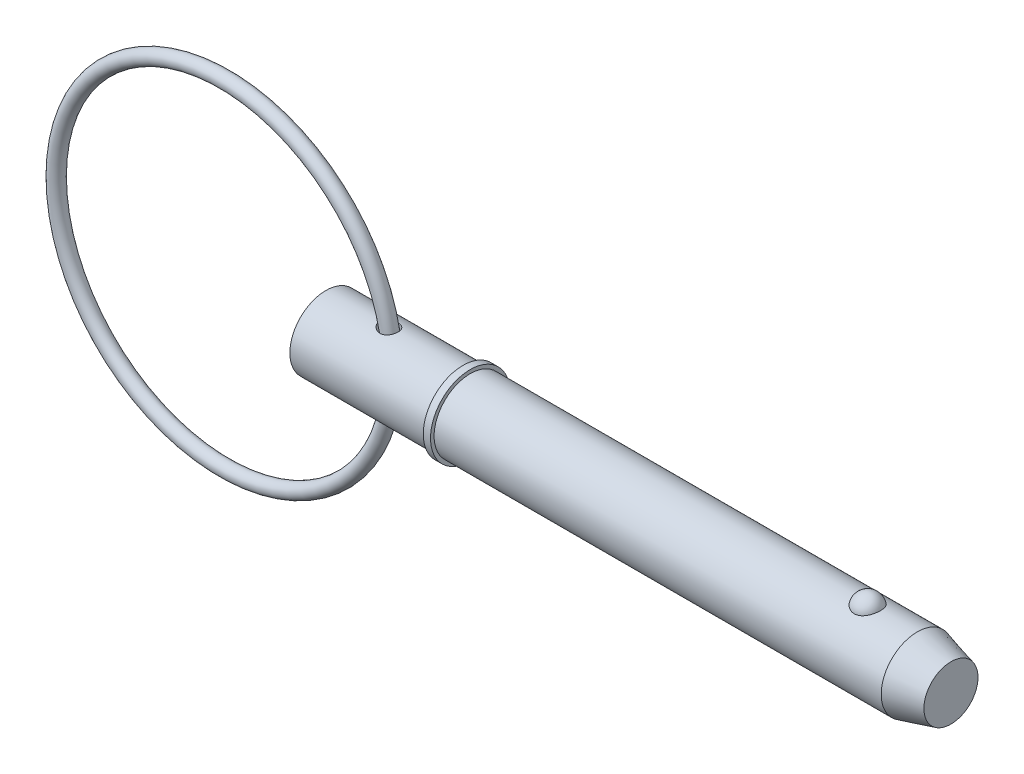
ISO-10303-21;
HEADER;
FILE_DESCRIPTION(('STEP AP214'),'2;1');
FILE_NAME('part.step','',(''),(''),'','','');
FILE_SCHEMA(('AUTOMOTIVE_DESIGN { 1 0 10303 214 1 1 1 1 }'));
ENDSEC;
DATA;
#1=APPLICATION_CONTEXT('core data for automotive mechanical design processes');
#2=APPLICATION_PROTOCOL_DEFINITION('international standard','automotive_design',2000,#1);
#3=PRODUCT_CONTEXT('',#1,'mechanical');
#4=PRODUCT('Part','Part','',(#3));
#5=PRODUCT_RELATED_PRODUCT_CATEGORY('part','',(#4));
#6=PRODUCT_DEFINITION_FORMATION('','',#4);
#7=PRODUCT_DEFINITION_CONTEXT('part definition',#1,'design');
#8=PRODUCT_DEFINITION('design','',#6,#7);
#9=PRODUCT_DEFINITION_SHAPE('','',#8);
#10=(LENGTH_UNIT() NAMED_UNIT(*) SI_UNIT(.MILLI.,.METRE.));
#11=(NAMED_UNIT(*) PLANE_ANGLE_UNIT() SI_UNIT($,.RADIAN.));
#12=(NAMED_UNIT(*) SI_UNIT($,.STERADIAN.) SOLID_ANGLE_UNIT());
#13=UNCERTAINTY_MEASURE_WITH_UNIT(LENGTH_MEASURE(1.E-05),#10,'distance_accuracy_value','');
#14=(GEOMETRIC_REPRESENTATION_CONTEXT(3) GLOBAL_UNCERTAINTY_ASSIGNED_CONTEXT((#13)) GLOBAL_UNIT_ASSIGNED_CONTEXT((#10,
#11,#12)) REPRESENTATION_CONTEXT('',''));
#15=CARTESIAN_POINT('',(0.,0.,0.));
#16=DIRECTION('',(0.,0.,1.));
#17=DIRECTION('',(1.,0.,0.));
#18=AXIS2_PLACEMENT_3D('',#15,#16,#17);
#19=CARTESIAN_POINT('',(-13.4013067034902,0.,0.));
#20=DIRECTION('',(0.,0.,1.));
#21=DIRECTION('',(1.,0.,0.));
#22=AXIS2_PLACEMENT_3D('',#19,#20,#21);
#23=TOROIDAL_SURFACE('',#22,22.225,0.952999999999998);
#24=CARTESIAN_POINT('',(9.77669329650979,0.,0.));
#25=VERTEX_POINT('',#24);
#26=VERTEX_LOOP('',#25);
#27=FACE_BOUND('',#26,.T.);
#28=ADVANCED_FACE('P0_F12',(#27),#23,.T.);
#29=CLOSED_SHELL('',(#28));
#30=MANIFOLD_SOLID_BREP('P0_B1',#29);
#31=CARTESIAN_POINT('',(0.,0.,0.));
#32=DIRECTION('',(1.,0.,0.));
#33=DIRECTION('',(0.,0.,-1.));
#34=AXIS2_PLACEMENT_3D('',#31,#32,#33);
#35=CYLINDRICAL_SURFACE('',#34,4.765);
#36=CARTESIAN_POINT('',(7.48459594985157,4.685973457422,-0.864220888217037));
#37=CARTESIAN_POINT('',(7.53849733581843,4.67711144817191,-0.912273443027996));
#38=CARTESIAN_POINT('',(7.59654891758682,4.66833039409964,-0.955745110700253));
#39=CARTESIAN_POINT('',(7.71924602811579,4.65195567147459,-1.03251233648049));
#40=CARTESIAN_POINT('',(7.78389917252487,4.64436340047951,-1.06579596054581));
#41=CARTESIAN_POINT('',(7.91808098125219,4.63129108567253,-1.12124172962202));
#42=CARTESIAN_POINT('',(7.98761280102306,4.62581242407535,-1.14339659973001));
#43=CARTESIAN_POINT('',(8.12956198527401,4.61771699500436,-1.17566870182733));
#44=CARTESIAN_POINT('',(8.20197774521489,4.61509865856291,-1.18579253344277));
#45=CARTESIAN_POINT('',(8.34550810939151,4.6131791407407,-1.19323853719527));
#46=CARTESIAN_POINT('',(8.41660306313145,4.61378793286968,-1.19090812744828));
#47=CARTESIAN_POINT('',(8.55721866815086,4.61812874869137,-1.17396277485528));
#48=CARTESIAN_POINT('',(8.62673979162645,4.62185982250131,-1.15935156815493));
#49=CARTESIAN_POINT('',(8.75801373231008,4.63172632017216,-1.11925454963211));
#50=CARTESIAN_POINT('',(8.81998342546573,4.63771186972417,-1.09443918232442));
#51=CARTESIAN_POINT('',(8.93863698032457,4.65140179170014,-1.03470792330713));
#52=CARTESIAN_POINT('',(8.99532131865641,4.65910600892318,-0.999792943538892));
#53=CARTESIAN_POINT('',(9.10080884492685,4.67519705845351,-0.921583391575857));
#54=CARTESIAN_POINT('',(9.14973848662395,4.68356861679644,-0.878455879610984));
#55=CARTESIAN_POINT('',(9.23971126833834,4.70019813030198,-0.784620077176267));
#56=CARTESIAN_POINT('',(9.28075401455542,4.7084560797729,-0.733911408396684));
#57=CARTESIAN_POINT('',(9.35441071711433,4.7240688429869,-0.62563775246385));
#58=CARTESIAN_POINT('',(9.38691359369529,4.73141115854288,-0.567995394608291));
#59=CARTESIAN_POINT('',(9.44203216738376,4.74427907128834,-0.447974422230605));
#60=CARTESIAN_POINT('',(9.46464743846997,4.74980459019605,-0.385595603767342));
#61=CARTESIAN_POINT('',(9.49961110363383,4.75848927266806,-0.257248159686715));
#62=CARTESIAN_POINT('',(9.51186382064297,4.76162635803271,-0.191251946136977));
#63=CARTESIAN_POINT('',(9.52545294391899,4.76511165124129,-0.0580729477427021));
#64=CARTESIAN_POINT('',(9.52678936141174,4.76545986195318,0.00910983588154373));
#65=CARTESIAN_POINT('',(9.51851557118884,4.76333054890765,0.142723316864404));
#66=CARTESIAN_POINT('',(9.50891008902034,4.76085424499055,0.209154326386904));
#67=CARTESIAN_POINT('',(9.47899306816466,4.75334441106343,0.339411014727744));
#68=CARTESIAN_POINT('',(9.45868126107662,4.74831081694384,0.403236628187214));
#69=CARTESIAN_POINT('',(9.4078294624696,4.73622777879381,0.526509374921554));
#70=CARTESIAN_POINT('',(9.37728413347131,4.72917728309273,0.585954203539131));
#71=CARTESIAN_POINT('',(9.30671117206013,4.71383320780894,0.698745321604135));
#72=CARTESIAN_POINT('',(9.26668347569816,4.70553961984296,0.752091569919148));
#73=CARTESIAN_POINT('',(9.17821531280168,4.68864637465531,0.851083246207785));
#74=CARTESIAN_POINT('',(9.12978756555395,4.68004719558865,0.896740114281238));
#75=CARTESIAN_POINT('',(9.02575872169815,4.66350833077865,0.97912505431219));
#76=CARTESIAN_POINT('',(8.97015856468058,4.65556855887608,1.01585429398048));
#77=CARTESIAN_POINT('',(8.85409306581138,4.6413534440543,1.0789347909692));
#78=CARTESIAN_POINT('',(8.79369898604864,4.63505812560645,1.10541268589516));
#79=CARTESIAN_POINT('',(8.66918290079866,4.62469916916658,1.1479836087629));
#80=CARTESIAN_POINT('',(8.60506121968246,4.62063533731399,1.1640775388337));
#81=CARTESIAN_POINT('',(8.47537782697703,4.61517348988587,1.18554696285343));
#82=CARTESIAN_POINT('',(8.4098281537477,4.61375835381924,1.19099130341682));
#83=CARTESIAN_POINT('',(8.2786938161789,4.61362908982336,1.19149080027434));
#84=CARTESIAN_POINT('',(8.21310914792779,4.61491539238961,1.18654430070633));
#85=CARTESIAN_POINT('',(8.08152457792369,4.62006017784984,1.16635311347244));
#86=CARTESIAN_POINT('',(8.01557748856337,4.62399895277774,1.15078675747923));
#87=CARTESIAN_POINT('',(7.88704537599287,4.63403793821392,1.10966738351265));
#88=CARTESIAN_POINT('',(7.82446148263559,4.64013886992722,1.08411103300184));
#89=CARTESIAN_POINT('',(7.70057947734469,4.65423592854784,1.02195168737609));
#90=CARTESIAN_POINT('',(7.63957197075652,4.66232221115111,0.984788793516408));
#91=CARTESIAN_POINT('',(7.52457021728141,4.67924552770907,0.900950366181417));
#92=CARTESIAN_POINT('',(7.47057819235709,4.68808279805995,0.854271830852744));
#93=CARTESIAN_POINT('',(7.37028930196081,4.70567913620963,0.751386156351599));
#94=CARTESIAN_POINT('',(7.32416327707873,4.7144333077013,0.695010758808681));
#95=CARTESIAN_POINT('',(7.24276674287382,4.73060166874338,0.574719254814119));
#96=CARTESIAN_POINT('',(7.20749051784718,4.73801656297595,0.510807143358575));
#97=CARTESIAN_POINT('',(7.15148495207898,4.75009927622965,0.381705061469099));
#98=CARTESIAN_POINT('',(7.12994463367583,4.7549169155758,0.31688231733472));
#99=CARTESIAN_POINT('',(7.09904467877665,4.76189692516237,0.184270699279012));
#100=CARTESIAN_POINT('',(7.08967554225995,4.76406136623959,0.116484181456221));
#101=CARTESIAN_POINT('',(7.08394150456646,4.76538257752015,-0.0133529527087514));
#102=CARTESIAN_POINT('',(7.0864533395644,4.76479916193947,-0.0753538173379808));
#103=CARTESIAN_POINT('',(7.10181380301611,4.76127985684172,-0.197993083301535));
#104=CARTESIAN_POINT('',(7.11466291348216,4.75834385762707,-0.258631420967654));
#105=CARTESIAN_POINT('',(7.14973937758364,4.75051877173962,-0.375744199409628));
#106=CARTESIAN_POINT('',(7.17178938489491,4.7456667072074,-0.432274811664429));
#107=CARTESIAN_POINT('',(7.22432962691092,4.73449674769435,-0.54107038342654));
#108=CARTESIAN_POINT('',(7.25481702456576,4.72817934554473,-0.593336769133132));
#109=CARTESIAN_POINT('',(7.31700895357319,4.71588241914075,-0.683642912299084));
#110=CARTESIAN_POINT('',(7.34750058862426,4.7100477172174,-0.722547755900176));
#111=CARTESIAN_POINT('',(7.41288050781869,4.69812059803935,-0.796421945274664));
#112=CARTESIAN_POINT('',(7.44776960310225,4.69202813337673,-0.831390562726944));
#113=CARTESIAN_POINT('',(7.48459594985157,4.685973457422,-0.864220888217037));
#114=B_SPLINE_CURVE_WITH_KNOTS('',3,(#36,#37,#38,#39,#40,#41,#42,#43,#44,#45,#46,#47,#48,#49,
#50,#51,#52,#53,#54,#55,#56,#57,#58,#59,#60,#61,#62,#63,#64,#65,#66,#67,#68,#69,#70,#71,#72,#73,
#74,#75,#76,#77,#78,#79,#80,#81,#82,#83,#84,#85,#86,#87,#88,#89,#90,#91,#92,#93,#94,#95,#96,#97,
#98,#99,#100,#101,#102,#103,#104,#105,#106,#107,#108,#109,#110,#111,#112,#113),.UNSPECIFIED.,
.T.,.F.,(4,2,2,2,2,2,2,2,2,2,2,2,2,2,2,2,2,2,2,2,2,2,2,2,2,2,2,2,2,2,2,2,2,2,2,2,2,2,4),(0.,
0.218078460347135,0.436411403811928,0.654886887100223,0.873242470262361,1.08553925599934,
1.2977714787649,1.49785367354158,1.6979178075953,1.8942789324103,2.09064985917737,
2.28946102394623,2.48828075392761,2.68891673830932,2.88955251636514,3.09010167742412,
3.29065586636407,3.49131482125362,3.69197512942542,3.89233421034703,4.09266707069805,
4.29043955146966,4.48819484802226,4.68466743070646,4.8811713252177,5.08390806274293,
5.28671248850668,5.50140943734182,5.71617422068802,5.93513249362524,6.15397522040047,
6.35827356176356,6.56241234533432,6.74765856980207,6.93291343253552,7.11475139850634,
7.29652829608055,7.44549570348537,7.59449062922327),.UNSPECIFIED.);
#115=CARTESIAN_POINT('',(7.48459594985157,4.685973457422,-0.864220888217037));
#116=VERTEX_POINT('',#115);
#117=EDGE_CURVE('P1_E42',#116,#116,#114,.T.);
#118=ORIENTED_EDGE('',*,*,#117,.T.);
#119=EDGE_LOOP('',(#118));
#120=FACE_BOUND('',#119,.T.);
#121=CARTESIAN_POINT('',(0.,0.,0.));
#122=DIRECTION('',(1.,0.,0.));
#123=DIRECTION('',(0.,0.,-1.));
#124=AXIS2_PLACEMENT_3D('',#121,#122,#123);
#125=CIRCLE('',#124,4.765);
#126=CARTESIAN_POINT('',(0.,0.,-4.765));
#127=VERTEX_POINT('',#126);
#128=EDGE_CURVE('P1_E9',#127,#127,#125,.T.);
#129=ORIENTED_EDGE('',*,*,#128,.T.);
#130=EDGE_LOOP('',(#129));
#131=FACE_BOUND('',#130,.T.);
#132=CARTESIAN_POINT('',(18.097,0.,0.));
#133=DIRECTION('',(1.,0.,0.));
#134=DIRECTION('',(0.,0.,-1.));
#135=AXIS2_PLACEMENT_3D('',#132,#133,#134);
#136=CIRCLE('',#135,4.765);
#137=CARTESIAN_POINT('',(18.097,0.,-4.765));
#138=VERTEX_POINT('',#137);
#139=EDGE_CURVE('P1_E25',#138,#138,#136,.T.);
#140=ORIENTED_EDGE('',*,*,#139,.F.);
#141=EDGE_LOOP('',(#140));
#142=FACE_BOUND('',#141,.T.);
#143=CARTESIAN_POINT('',(7.48459594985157,-4.685973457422,-0.864220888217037));
#144=CARTESIAN_POINT('',(7.43440944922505,-4.6942250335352,-0.819477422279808));
#145=CARTESIAN_POINT('',(7.38778663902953,-4.70255210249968,-0.77073361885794));
#146=CARTESIAN_POINT('',(7.3030968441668,-4.7184989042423,-0.666172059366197));
#147=CARTESIAN_POINT('',(7.26503010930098,-4.72611861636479,-0.610354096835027));
#148=CARTESIAN_POINT('',(7.19878266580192,-4.73983819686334,-0.492624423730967));
#149=CARTESIAN_POINT('',(7.17064194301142,-4.74593188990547,-0.430689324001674));
#150=CARTESIAN_POINT('',(7.12584349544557,-4.75581281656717,-0.3026233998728));
#151=CARTESIAN_POINT('',(7.10917889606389,-4.75960143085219,-0.236495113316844));
#152=CARTESIAN_POINT('',(7.0889853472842,-4.76421379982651,-0.106818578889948));
#153=CARTESIAN_POINT('',(7.0846333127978,-4.76522320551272,-0.0434047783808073));
#154=CARTESIAN_POINT('',(7.08693064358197,-4.7646936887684,0.0832041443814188));
#155=CARTESIAN_POINT('',(7.09357756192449,-4.76315533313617,0.146399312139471));
#156=CARTESIAN_POINT('',(7.11694629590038,-4.75784365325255,0.267709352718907));
#157=CARTESIAN_POINT('',(7.13318365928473,-4.75417793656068,0.325923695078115));
#158=CARTESIAN_POINT('',(7.17459606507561,-4.74508048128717,0.438922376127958));
#159=CARTESIAN_POINT('',(7.19977257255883,-4.73964845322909,0.493706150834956));
#160=CARTESIAN_POINT('',(7.25946789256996,-4.72725615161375,0.60111049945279));
#161=CARTESIAN_POINT('',(7.2943661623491,-4.72023663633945,0.653512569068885));
#162=CARTESIAN_POINT('',(7.37173226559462,-4.70550732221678,0.752279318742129));
#163=CARTESIAN_POINT('',(7.41420315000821,-4.69779724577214,0.798641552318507));
#164=CARTESIAN_POINT('',(7.50982312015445,-4.6816641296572,0.888551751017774));
#165=CARTESIAN_POINT('',(7.56359853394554,-4.67324162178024,0.931434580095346));
#166=CARTESIAN_POINT('',(7.67736628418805,-4.65728554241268,1.00819498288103));
#167=CARTESIAN_POINT('',(7.7373611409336,-4.64975233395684,1.04206888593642));
#168=CARTESIAN_POINT('',(7.86574076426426,-4.63599923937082,1.10169445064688));
#169=CARTESIAN_POINT('',(7.93441048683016,-4.62988111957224,1.12685968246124));
#170=CARTESIAN_POINT('',(8.07519000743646,-4.62035710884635,1.16529928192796));
#171=CARTESIAN_POINT('',(8.14729925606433,-4.61695078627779,1.1785755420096));
#172=CARTESIAN_POINT('',(8.29111621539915,-4.61341807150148,1.19232949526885));
#173=CARTESIAN_POINT('',(8.36279361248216,-4.61321655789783,1.19310032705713));
#174=CARTESIAN_POINT('',(8.50512944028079,-4.61602317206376,1.1821962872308));
#175=CARTESIAN_POINT('',(8.57578827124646,-4.61903000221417,1.17052644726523));
#176=CARTESIAN_POINT('',(8.70965757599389,-4.62766311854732,1.13589249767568));
#177=CARTESIAN_POINT('',(8.77306169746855,-4.63312492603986,1.11363308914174));
#178=CARTESIAN_POINT('',(8.8949702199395,-4.64598463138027,1.05869880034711));
#179=CARTESIAN_POINT('',(8.95347516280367,-4.65338231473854,1.02602507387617));
#180=CARTESIAN_POINT('',(9.06253415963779,-4.66906009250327,0.952097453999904));
#181=CARTESIAN_POINT('',(9.11324728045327,-4.67731427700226,0.911072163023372));
#182=CARTESIAN_POINT('',(9.20707850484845,-4.69393979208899,0.821122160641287));
#183=CARTESIAN_POINT('',(9.25019629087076,-4.70231112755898,0.772197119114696));
#184=CARTESIAN_POINT('',(9.32819072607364,-4.71835356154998,0.667239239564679));
#185=CARTESIAN_POINT('',(9.36297449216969,-4.72601623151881,0.611136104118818));
#186=CARTESIAN_POINT('',(9.42286382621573,-4.73971239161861,0.493799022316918));
#187=CARTESIAN_POINT('',(9.44796891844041,-4.74574580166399,0.432564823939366));
#188=CARTESIAN_POINT('',(9.48811605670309,-4.75559286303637,0.305990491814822));
#189=CARTESIAN_POINT('',(9.50304870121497,-4.75938232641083,0.240613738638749));
#190=CARTESIAN_POINT('',(9.5220569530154,-4.76423188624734,0.108201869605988));
#191=CARTESIAN_POINT('',(9.52613255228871,-4.76529198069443,0.0411667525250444));
#192=CARTESIAN_POINT('',(9.52332772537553,-4.76456884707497,-0.0926701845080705));
#193=CARTESIAN_POINT('',(9.51644541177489,-4.76278512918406,-0.159471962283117));
#194=CARTESIAN_POINT('',(9.49188827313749,-4.75656536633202,-0.290934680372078));
#195=CARTESIAN_POINT('',(9.47421322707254,-4.75212926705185,-0.355595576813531));
#196=CARTESIAN_POINT('',(9.42849503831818,-4.74108318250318,-0.480955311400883));
#197=CARTESIAN_POINT('',(9.4004503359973,-4.73447287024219,-0.541653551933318));
#198=CARTESIAN_POINT('',(9.33467290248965,-4.71979928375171,-0.657361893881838));
#199=CARTESIAN_POINT('',(9.29694000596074,-4.71173598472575,-0.712371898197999));
#200=CARTESIAN_POINT('',(9.2127449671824,-4.69505469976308,-0.815106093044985));
#201=CARTESIAN_POINT('',(9.1662875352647,-4.68643701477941,-0.862834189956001));
#202=CARTESIAN_POINT('',(9.06584125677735,-4.66961864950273,-0.949656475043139));
#203=CARTESIAN_POINT('',(9.01185326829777,-4.66141792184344,-0.98875164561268));
#204=CARTESIAN_POINT('',(8.8985010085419,-4.64646376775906,-1.0567894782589));
#205=CARTESIAN_POINT('',(8.83920621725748,-4.63969468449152,-1.08584444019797));
#206=CARTESIAN_POINT('',(8.71642097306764,-4.62824519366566,-1.13365785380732));
#207=CARTESIAN_POINT('',(8.65293102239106,-4.623564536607,-1.15241753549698));
#208=CARTESIAN_POINT('',(8.52421291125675,-4.61681938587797,-1.17914952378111));
#209=CARTESIAN_POINT('',(8.45900634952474,-4.6147310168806,-1.18722032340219));
#210=CARTESIAN_POINT('',(8.32811210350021,-4.61325848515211,-1.19292878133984));
#211=CARTESIAN_POINT('',(8.26242433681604,-4.61387479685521,-1.19056460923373));
#212=CARTESIAN_POINT('',(8.13057358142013,-4.6177227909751,-1.17555160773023));
#213=CARTESIAN_POINT('',(8.06444352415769,-4.62102282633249,-1.16263394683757));
#214=CARTESIAN_POINT('',(7.93513143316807,-4.62989870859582,-1.12676570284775));
#215=CARTESIAN_POINT('',(7.87194976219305,-4.6354748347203,-1.10381388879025));
#216=CARTESIAN_POINT('',(7.75155849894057,-4.64811746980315,-1.04928030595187));
#217=CARTESIAN_POINT('',(7.69423767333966,-4.65514232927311,-1.01793362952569));
#218=CARTESIAN_POINT('',(7.58503138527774,-4.67007903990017,-0.947046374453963));
#219=CARTESIAN_POINT('',(7.53314612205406,-4.67799092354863,-0.907505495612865));
#220=CARTESIAN_POINT('',(7.48459594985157,-4.685973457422,-0.864220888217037));
#221=B_SPLINE_CURVE_WITH_KNOTS('',3,(#143,#144,#145,#146,#147,#148,#149,#150,#151,#152,#153,
#154,#155,#156,#157,#158,#159,#160,#161,#162,#163,#164,#165,#166,#167,#168,#169,#170,#171,#172,
#173,#174,#175,#176,#177,#178,#179,#180,#181,#182,#183,#184,#185,#186,#187,#188,#189,#190,#191,
#192,#193,#194,#195,#196,#197,#198,#199,#200,#201,#202,#203,#204,#205,#206,#207,#208,#209,#210,
#211,#212,#213,#214,#215,#216,#217,#218,#219,#220),.UNSPECIFIED.,.T.,.F.,(4,2,2,2,2,2,2,2,2,2,2,
2,2,2,2,2,2,2,2,2,2,2,2,2,2,2,2,2,2,2,2,2,2,2,2,2,2,2,4),(0.,0.203013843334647,
0.406033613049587,0.609862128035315,0.813568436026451,1.0032929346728,1.19297523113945,
1.37380897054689,1.55467236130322,1.74393241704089,1.93326889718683,2.14025373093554,
2.3473227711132,2.566425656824,2.78549366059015,2.9994188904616,3.21325763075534,
3.41451842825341,3.61575693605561,3.81208930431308,4.00842987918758,4.20686629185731,
4.40531245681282,4.60586051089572,4.80640871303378,5.0069914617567,5.20757831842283,
5.40819535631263,5.60881581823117,5.80932827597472,6.00981790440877,6.2079863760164,
6.40613116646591,6.60243714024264,6.79877754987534,7.00028133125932,7.20180983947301,
7.39819723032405,7.59459181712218),.UNSPECIFIED.);
#222=CARTESIAN_POINT('',(7.48459594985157,-4.685973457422,-0.864220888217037));
#223=VERTEX_POINT('',#222);
#224=EDGE_CURVE('P1_E17',#223,#223,#221,.T.);
#225=ORIENTED_EDGE('',*,*,#224,.T.);
#226=EDGE_LOOP('',(#225));
#227=FACE_BOUND('',#226,.T.);
#228=ADVANCED_FACE('P1_F13',(#120,#131,#142,#227),#35,.T.);
#229=CARTESIAN_POINT('',(0.,0.,0.));
#230=DIRECTION('',(1.,0.,0.));
#231=DIRECTION('',(0.,0.,-1.));
#232=AXIS2_PLACEMENT_3D('',#229,#230,#231);
#233=CYLINDRICAL_SURFACE('',#232,4.765);
#234=CARTESIAN_POINT('',(78.1041944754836,0.,0.));
#235=DIRECTION('',(1.,0.,0.));
#236=DIRECTION('',(0.,0.,-1.));
#237=AXIS2_PLACEMENT_3D('',#234,#235,#236);
#238=CIRCLE('',#237,4.765);
#239=CARTESIAN_POINT('',(78.1041944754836,0.,-4.765));
#240=VERTEX_POINT('',#239);
#241=EDGE_CURVE('P1_E99',#240,#240,#238,.T.);
#242=ORIENTED_EDGE('',*,*,#241,.F.);
#243=EDGE_LOOP('',(#242));
#244=FACE_BOUND('',#243,.T.);
#245=CARTESIAN_POINT('',(19.05,0.,0.));
#246=DIRECTION('',(1.,0.,0.));
#247=DIRECTION('',(0.,0.,-1.));
#248=AXIS2_PLACEMENT_3D('',#245,#246,#247);
#249=CIRCLE('',#248,4.765);
#250=CARTESIAN_POINT('',(19.05,0.,-4.765));
#251=VERTEX_POINT('',#250);
#252=EDGE_CURVE('P1_E96',#251,#251,#249,.T.);
#253=ORIENTED_EDGE('',*,*,#252,.T.);
#254=EDGE_LOOP('',(#253));
#255=FACE_BOUND('',#254,.T.);
#256=CARTESIAN_POINT('',(71.551020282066,4.42764777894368,1.76101111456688));
#257=CARTESIAN_POINT('',(71.4597212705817,4.42764470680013,1.76101422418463));
#258=CARTESIAN_POINT('',(71.3684468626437,4.43059091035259,1.75366340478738));
#259=CARTESIAN_POINT('',(71.188615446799,4.44201846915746,1.72451180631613));
#260=CARTESIAN_POINT('',(71.1000577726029,4.45049845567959,1.70271460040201));
#261=CARTESIAN_POINT('',(70.9282570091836,4.47200516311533,1.6453937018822));
#262=CARTESIAN_POINT('',(70.8450064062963,4.48502527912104,1.60988994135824));
#263=CARTESIAN_POINT('',(70.6857633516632,4.51419542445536,1.52617873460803));
#264=CARTESIAN_POINT('',(70.6097723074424,4.53034605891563,1.47796883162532));
#265=CARTESIAN_POINT('',(70.4647445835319,4.5645931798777,1.36860494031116));
#266=CARTESIAN_POINT('',(70.3959645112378,4.58273170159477,1.30712420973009));
#267=CARTESIAN_POINT('',(70.2693423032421,4.61870302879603,1.1737020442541));
#268=CARTESIAN_POINT('',(70.2115021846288,4.63653577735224,1.1017586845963));
#269=CARTESIAN_POINT('',(70.1055709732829,4.67090140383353,0.945806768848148));
#270=CARTESIAN_POINT('',(70.0580305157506,4.68734068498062,0.861402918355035));
#271=CARTESIAN_POINT('',(69.9770817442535,4.71628466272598,0.685442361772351));
#272=CARTESIAN_POINT('',(69.9436747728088,4.72878898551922,0.593884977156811));
#273=CARTESIAN_POINT('',(69.891287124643,4.74874061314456,0.404781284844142));
#274=CARTESIAN_POINT('',(69.8725178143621,4.75611366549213,0.307168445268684));
#275=CARTESIAN_POINT('',(69.8505846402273,4.76475393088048,0.109940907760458));
#276=CARTESIAN_POINT('',(69.8474205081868,4.76602124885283,0.0103262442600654));
#277=CARTESIAN_POINT('',(69.8567405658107,4.76232928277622,-0.18762912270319));
#278=CARTESIAN_POINT('',(69.8691588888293,4.7573962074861,-0.285973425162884));
#279=CARTESIAN_POINT('',(69.9092804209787,4.74184975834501,-0.479027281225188));
#280=CARTESIAN_POINT('',(69.9369839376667,4.7312362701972,-0.573736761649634));
#281=CARTESIAN_POINT('',(70.0071581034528,4.70540026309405,-0.756973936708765));
#282=CARTESIAN_POINT('',(70.0496460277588,4.69017235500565,-0.845494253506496));
#283=CARTESIAN_POINT('',(70.148520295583,4.6566986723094,-1.01378033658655));
#284=CARTESIAN_POINT('',(70.2049076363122,4.63845268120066,-1.09354547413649));
#285=CARTESIAN_POINT('',(70.330552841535,4.60085438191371,-1.24228523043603));
#286=CARTESIAN_POINT('',(70.3998439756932,4.58149930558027,-1.31123108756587));
#287=CARTESIAN_POINT('',(70.5496066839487,4.54391653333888,-1.43607409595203));
#288=CARTESIAN_POINT('',(70.6300771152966,4.52568872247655,-1.49197257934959));
#289=CARTESIAN_POINT('',(70.7981500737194,4.49293007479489,-1.58786764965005));
#290=CARTESIAN_POINT('',(70.8855445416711,4.47832346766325,-1.62820219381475));
#291=CARTESIAN_POINT('',(71.066553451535,4.45406011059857,-1.69345757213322));
#292=CARTESIAN_POINT('',(71.1601655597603,4.44440151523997,-1.71838415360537));
#293=CARTESIAN_POINT('',(71.3458939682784,4.43159888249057,-1.75112843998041));
#294=CARTESIAN_POINT('',(71.437849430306,4.42815213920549,-1.75974223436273));
#295=CARTESIAN_POINT('',(71.6219658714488,4.427247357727,-1.76201865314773));
#296=CARTESIAN_POINT('',(71.7141268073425,4.42978816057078,-1.7556841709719));
#297=CARTESIAN_POINT('',(71.8931292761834,4.4403864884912,-1.72869560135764));
#298=CARTESIAN_POINT('',(71.9800474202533,4.44827555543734,-1.70847853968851));
#299=CARTESIAN_POINT('',(72.1491314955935,4.46852246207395,-1.65479562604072));
#300=CARTESIAN_POINT('',(72.2312970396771,4.48088066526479,-1.62132869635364));
#301=CARTESIAN_POINT('',(72.3905916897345,4.50907357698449,-1.54120560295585));
#302=CARTESIAN_POINT('',(72.4675700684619,4.52497884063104,-1.49427526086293));
#303=CARTESIAN_POINT('',(72.6127080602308,4.55845148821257,-1.38881222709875));
#304=CARTESIAN_POINT('',(72.6808656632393,4.57601924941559,-1.33027689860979));
#305=CARTESIAN_POINT('',(72.8100990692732,4.61196537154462,-1.19991049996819));
#306=CARTESIAN_POINT('',(72.8706562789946,4.63034074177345,-1.12756415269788));
#307=CARTESIAN_POINT('',(72.9792797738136,4.66513959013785,-0.973612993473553));
#308=CARTESIAN_POINT('',(73.0273438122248,4.68156271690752,-0.892006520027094));
#309=CARTESIAN_POINT('',(73.111383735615,4.71130224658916,-0.718892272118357));
#310=CARTESIAN_POINT('',(73.1469185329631,4.724501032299,-0.627149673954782));
#311=CARTESIAN_POINT('',(73.2029522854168,4.74571823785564,-0.438611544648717));
#312=CARTESIAN_POINT('',(73.223450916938,4.75373654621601,-0.341815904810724));
#313=CARTESIAN_POINT('',(73.2490338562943,4.76378905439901,-0.145633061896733));
#314=CARTESIAN_POINT('',(73.254076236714,4.76580697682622,-0.0462395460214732));
#315=CARTESIAN_POINT('',(73.2485239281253,4.76360573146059,0.15203857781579));
#316=CARTESIAN_POINT('',(73.2379294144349,4.75938663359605,0.250923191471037));
#317=CARTESIAN_POINT('',(73.2013875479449,4.74516937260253,0.445004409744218));
#318=CARTESIAN_POINT('',(73.1754964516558,4.73519238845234,0.540213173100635));
#319=CARTESIAN_POINT('',(73.1089273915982,4.7104939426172,0.7246622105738));
#320=CARTESIAN_POINT('',(73.068248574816,4.69577220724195,0.813902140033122));
#321=CARTESIAN_POINT('',(72.9727177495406,4.66303767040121,0.984313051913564));
#322=CARTESIAN_POINT('',(72.9178042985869,4.64501070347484,1.06544688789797));
#323=CARTESIAN_POINT('',(72.7950496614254,4.60764678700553,1.21692673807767));
#324=CARTESIAN_POINT('',(72.7272086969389,4.58830985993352,1.2872729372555));
#325=CARTESIAN_POINT('',(72.5805480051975,4.55060370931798,1.41479271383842));
#326=CARTESIAN_POINT('',(72.5017918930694,4.53222967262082,1.47203785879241));
#327=CARTESIAN_POINT('',(72.3349890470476,4.49849576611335,1.57212016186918));
#328=CARTESIAN_POINT('',(72.2469417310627,4.48313608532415,1.61495641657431));
#329=CARTESIAN_POINT('',(72.0597918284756,4.45676184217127,1.68642657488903));
#330=CARTESIAN_POINT('',(71.9603653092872,4.44598302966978,1.71430590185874));
#331=CARTESIAN_POINT('',(71.7576210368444,4.43142918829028,1.7515925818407));
#332=CARTESIAN_POINT('',(71.6543049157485,4.42765125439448,1.76100759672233));
#333=CARTESIAN_POINT('',(71.551020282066,4.42764777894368,1.76101111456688));
#334=B_SPLINE_CURVE_WITH_KNOTS('',3,(#256,#257,#258,#259,#260,#261,#262,#263,#264,#265,#266,
#267,#268,#269,#270,#271,#272,#273,#274,#275,#276,#277,#278,#279,#280,#281,#282,#283,#284,#285,
#286,#287,#288,#289,#290,#291,#292,#293,#294,#295,#296,#297,#298,#299,#300,#301,#302,#303,#304,
#305,#306,#307,#308,#309,#310,#311,#312,#313,#314,#315,#316,#317,#318,#319,#320,#321,#322,#323,
#324,#325,#326,#327,#328,#329,#330,#331,#332,#333),.UNSPECIFIED.,.T.,.F.,(4,2,2,2,2,2,2,2,2,2,2,
2,2,2,2,2,2,2,2,2,2,2,2,2,2,2,2,2,2,2,2,2,2,2,2,2,2,2,4),(0.,0.273517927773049,
0.546968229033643,0.820022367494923,1.09312934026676,1.37393946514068,1.65480131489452,
1.94820420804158,2.24163496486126,2.53922817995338,2.8368162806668,3.13315071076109,
3.42949110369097,3.72617893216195,4.02288805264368,4.32037303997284,4.61782764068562,
4.90840095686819,5.19886582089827,5.47474855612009,5.75057789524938,6.01809977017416,
6.28564340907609,6.55907787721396,6.83257454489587,7.11962987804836,7.40673679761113,
7.70312663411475,7.9995228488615,8.29672237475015,8.59391856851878,8.89002850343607,
9.18615552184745,9.48358266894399,9.78100471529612,10.0767610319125,10.3725358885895,
10.6820893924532,10.991514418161),.UNSPECIFIED.);
#335=CARTESIAN_POINT('',(71.551020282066,4.42764777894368,1.76101111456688));
#336=VERTEX_POINT('',#335);
#337=EDGE_CURVE('P1_E34',#336,#336,#334,.T.);
#338=ORIENTED_EDGE('',*,*,#337,.T.);
#339=EDGE_LOOP('',(#338));
#340=FACE_BOUND('',#339,.T.);
#341=ADVANCED_FACE('P1_F46',(#244,#255,#340),#233,.T.);
#342=CARTESIAN_POINT('',(0.,0.,0.));
#343=DIRECTION('',(-1.,0.,0.));
#344=DIRECTION('',(0.,0.,1.));
#345=AXIS2_PLACEMENT_3D('',#342,#343,#344);
#346=PLANE('',#345);
#347=ORIENTED_EDGE('',*,*,#128,.F.);
#348=EDGE_LOOP('',(#347));
#349=FACE_BOUND('',#348,.T.);
#350=ADVANCED_FACE('P1_F15',(#349),#346,.T.);
#351=CARTESIAN_POINT('',(18.097,4.765,0.));
#352=DIRECTION('',(-1.,0.,0.));
#353=DIRECTION('',(0.,0.,1.));
#354=AXIS2_PLACEMENT_3D('',#351,#352,#353);
#355=PLANE('',#354);
#356=ORIENTED_EDGE('',*,*,#139,.T.);
#357=EDGE_LOOP('',(#356));
#358=FACE_BOUND('',#357,.T.);
#359=CARTESIAN_POINT('',(18.097,0.,0.));
#360=DIRECTION('',(1.,0.,0.));
#361=DIRECTION('',(0.,0.,-1.));
#362=AXIS2_PLACEMENT_3D('',#359,#360,#361);
#363=CIRCLE('',#362,5.2415);
#364=CARTESIAN_POINT('',(18.097,0.,-5.2415));
#365=VERTEX_POINT('',#364);
#366=EDGE_CURVE('P1_E30',#365,#365,#363,.T.);
#367=ORIENTED_EDGE('',*,*,#366,.F.);
#368=EDGE_LOOP('',(#367));
#369=FACE_BOUND('',#368,.T.);
#370=ADVANCED_FACE('P1_F81',(#358,#369),#355,.T.);
#371=CARTESIAN_POINT('',(0.,0.,0.));
#372=DIRECTION('',(1.,0.,0.));
#373=DIRECTION('',(0.,0.,-1.));
#374=AXIS2_PLACEMENT_3D('',#371,#372,#373);
#375=CYLINDRICAL_SURFACE('',#374,5.2415);
#376=ORIENTED_EDGE('',*,*,#366,.T.);
#377=EDGE_LOOP('',(#376));
#378=FACE_BOUND('',#377,.T.);
#379=CARTESIAN_POINT('',(19.05,0.,0.));
#380=DIRECTION('',(1.,0.,0.));
#381=DIRECTION('',(0.,0.,-1.));
#382=AXIS2_PLACEMENT_3D('',#379,#380,#381);
#383=CIRCLE('',#382,5.2415);
#384=CARTESIAN_POINT('',(19.05,0.,-5.2415));
#385=VERTEX_POINT('',#384);
#386=EDGE_CURVE('P1_E95',#385,#385,#383,.T.);
#387=ORIENTED_EDGE('',*,*,#386,.F.);
#388=EDGE_LOOP('',(#387));
#389=FACE_BOUND('',#388,.T.);
#390=ADVANCED_FACE('P1_F68',(#378,#389),#375,.T.);
#391=CARTESIAN_POINT('',(19.05,5.2415,0.));
#392=DIRECTION('',(1.,0.,0.));
#393=DIRECTION('',(0.,0.,-1.));
#394=AXIS2_PLACEMENT_3D('',#391,#392,#393);
#395=PLANE('',#394);
#396=ORIENTED_EDGE('',*,*,#386,.T.);
#397=EDGE_LOOP('',(#396));
#398=FACE_BOUND('',#397,.T.);
#399=ORIENTED_EDGE('',*,*,#252,.F.);
#400=EDGE_LOOP('',(#399));
#401=FACE_BOUND('',#400,.T.);
#402=ADVANCED_FACE('P1_F62',(#398,#401),#395,.T.);
#403=CARTESIAN_POINT('',(82.55,0.,0.));
#404=DIRECTION('',(-1.,0.,0.));
#405=DIRECTION('',(0.,0.,1.));
#406=AXIS2_PLACEMENT_3D('',#403,#404,#405);
#407=CONICAL_SURFACE('',#406,3.57375000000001,0.26179938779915);
#408=ORIENTED_EDGE('',*,*,#241,.T.);
#409=EDGE_LOOP('',(#408));
#410=FACE_BOUND('',#409,.T.);
#411=CARTESIAN_POINT('',(82.55,0.,0.));
#412=DIRECTION('',(1.,0.,0.));
#413=DIRECTION('',(0.,0.,-1.));
#414=AXIS2_PLACEMENT_3D('',#411,#412,#413);
#415=CIRCLE('',#414,3.57375000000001);
#416=CARTESIAN_POINT('',(82.55,0.,-3.57375000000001));
#417=VERTEX_POINT('',#416);
#418=EDGE_CURVE('P1_E41',#417,#417,#415,.T.);
#419=ORIENTED_EDGE('',*,*,#418,.F.);
#420=EDGE_LOOP('',(#419));
#421=FACE_BOUND('',#420,.T.);
#422=ADVANCED_FACE('P1_F59',(#410,#421),#407,.T.);
#423=CARTESIAN_POINT('',(82.55,3.57375000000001,0.));
#424=DIRECTION('',(1.,0.,0.));
#425=DIRECTION('',(0.,0.,-1.));
#426=AXIS2_PLACEMENT_3D('',#423,#424,#425);
#427=PLANE('',#426);
#428=ORIENTED_EDGE('',*,*,#418,.T.);
#429=EDGE_LOOP('',(#428));
#430=FACE_BOUND('',#429,.T.);
#431=ADVANCED_FACE('P1_F55',(#430),#427,.T.);
#432=CARTESIAN_POINT('',(71.551020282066,4.28849999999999,0.));
#433=DIRECTION('',(-1.,0.,0.));
#434=DIRECTION('',(0.,1.,0.));
#435=AXIS2_PLACEMENT_3D('',#432,#433,#434);
#436=SPHERICAL_SURFACE('',#435,1.7665);
#437=ORIENTED_EDGE('',*,*,#337,.F.);
#438=EDGE_LOOP('',(#437));
#439=FACE_BOUND('',#438,.T.);
#440=ADVANCED_FACE('P1_F50',(#439),#436,.T.);
#441=CARTESIAN_POINT('',(-13.4013067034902,0.,0.));
#442=DIRECTION('',(0.,0.,1.));
#443=DIRECTION('',(1.,0.,0.));
#444=AXIS2_PLACEMENT_3D('',#441,#442,#443);
#445=TOROIDAL_SURFACE('',#444,22.225,1.19125);
#446=ORIENTED_EDGE('',*,*,#224,.F.);
#447=EDGE_LOOP('',(#446));
#448=FACE_BOUND('',#447,.T.);
#449=ORIENTED_EDGE('',*,*,#117,.F.);
#450=EDGE_LOOP('',(#449));
#451=FACE_BOUND('',#450,.T.);
#452=ADVANCED_FACE('P1_F54',(#448,#451),#445,.F.);
#453=CLOSED_SHELL('',(#228,#341,#350,#370,#390,#402,#422,#431,#440,#452));
#454=MANIFOLD_SOLID_BREP('P1_B1',#453);
#455=ADVANCED_BREP_SHAPE_REPRESENTATION('',(#18,#30,#454),#14);
#456=SHAPE_DEFINITION_REPRESENTATION(#9,#455);
ENDSEC;
END-ISO-10303-21;
